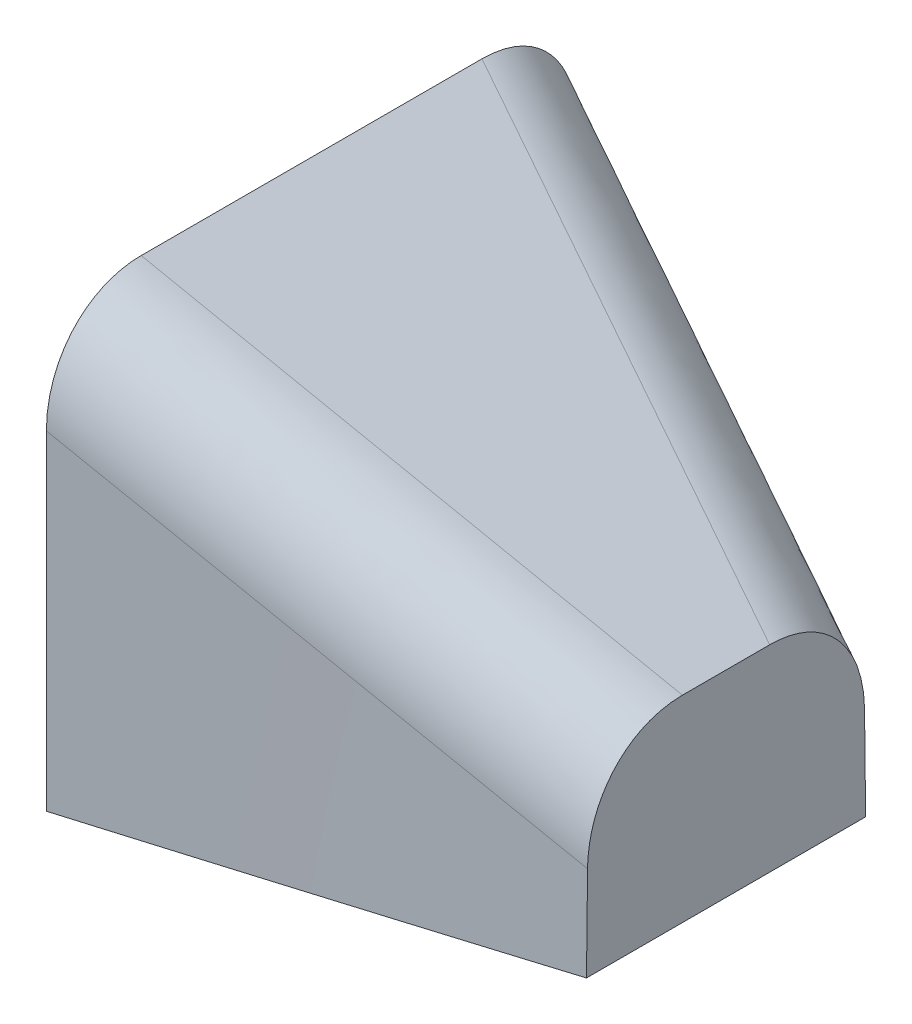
ISO-10303-21;
HEADER;
FILE_DESCRIPTION(('STEP AP214'),'2;1');
FILE_NAME('part.step','',(''),(''),'','','');
FILE_SCHEMA(('AUTOMOTIVE_DESIGN { 1 0 10303 214 1 1 1 1 }'));
ENDSEC;
DATA;
#1=APPLICATION_CONTEXT('core data for automotive mechanical design processes');
#2=APPLICATION_PROTOCOL_DEFINITION('international standard','automotive_design',2000,#1);
#3=PRODUCT_CONTEXT('',#1,'mechanical');
#4=PRODUCT('Part','Part','',(#3));
#5=PRODUCT_RELATED_PRODUCT_CATEGORY('part','',(#4));
#6=PRODUCT_DEFINITION_FORMATION('','',#4);
#7=PRODUCT_DEFINITION_CONTEXT('part definition',#1,'design');
#8=PRODUCT_DEFINITION('design','',#6,#7);
#9=PRODUCT_DEFINITION_SHAPE('','',#8);
#10=(LENGTH_UNIT() NAMED_UNIT(*) SI_UNIT(.MILLI.,.METRE.));
#11=(NAMED_UNIT(*) PLANE_ANGLE_UNIT() SI_UNIT($,.RADIAN.));
#12=(NAMED_UNIT(*) SI_UNIT($,.STERADIAN.) SOLID_ANGLE_UNIT());
#13=UNCERTAINTY_MEASURE_WITH_UNIT(LENGTH_MEASURE(1.E-05),#10,'distance_accuracy_value','');
#14=(GEOMETRIC_REPRESENTATION_CONTEXT(3) GLOBAL_UNCERTAINTY_ASSIGNED_CONTEXT((#13)) GLOBAL_UNIT_ASSIGNED_CONTEXT((#10,
#11,#12)) REPRESENTATION_CONTEXT('',''));
#15=CARTESIAN_POINT('',(0.,0.,0.));
#16=DIRECTION('',(0.,0.,1.));
#17=DIRECTION('',(1.,0.,0.));
#18=AXIS2_PLACEMENT_3D('',#15,#16,#17);
#19=CARTESIAN_POINT('',(0.,119.10399609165,-25.570067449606));
#20=DIRECTION('',(0.,-1.,0.));
#21=DIRECTION('',(0.,0.,-1.));
#22=AXIS2_PLACEMENT_3D('',#19,#20,#21);
#23=PLANE('',#22);
#24=CARTESIAN_POINT('',(39.0699557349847,119.10399609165,-13.1565904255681));
#25=CARTESIAN_POINT('',(37.215246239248,119.10399609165,-13.7293949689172));
#26=CARTESIAN_POINT('',(35.3600451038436,119.10399609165,-14.3006063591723));
#27=CARTESIAN_POINT('',(31.6487247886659,119.10399609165,-15.4400346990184));
#28=CARTESIAN_POINT('',(29.7926056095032,119.10399609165,-16.008251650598));
#29=CARTESIAN_POINT('',(26.079512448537,119.10399609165,-17.1418835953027));
#30=CARTESIAN_POINT('',(24.2225384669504,119.10399609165,-17.7072985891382));
#31=CARTESIAN_POINT('',(20.5077910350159,119.10399609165,-18.8354985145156));
#32=CARTESIAN_POINT('',(18.6500175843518,119.10399609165,-19.3982834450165));
#33=CARTESIAN_POINT('',(13.994811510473,119.10399609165,-20.8051346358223));
#34=CARTESIAN_POINT('',(11.1969067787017,119.10399609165,-21.6476387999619));
#35=CARTESIAN_POINT('',(5.59956452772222,119.10399609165,-23.3275341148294));
#36=CARTESIAN_POINT('',(2.80012700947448,119.10399609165,-24.1649252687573));
#37=CARTESIAN_POINT('',(0.,119.10399609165,-25.));
#38=B_SPLINE_CURVE_WITH_KNOTS('',3,(#24,#25,#26,#27,#28,#29,#30,#31,#32,#33,#34,#35,#36,#37),
.UNSPECIFIED.,.F.,.F.,(4,2,2,2,2,2,4),(0.,5.82344027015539,11.6468766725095,17.4703115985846,
23.2937488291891,32.0597435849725,40.8257328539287),.UNSPECIFIED.);
#39=CARTESIAN_POINT('',(39.0699557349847,119.10399609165,-13.1565904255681));
#40=VERTEX_POINT('',#39);
#41=CARTESIAN_POINT('',(0.,119.10399609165,-25.));
#42=VERTEX_POINT('',#41);
#43=EDGE_CURVE('E96',#40,#42,#38,.T.);
#44=ORIENTED_EDGE('',*,*,#43,.F.);
#45=DIRECTION('',(0.,0.,-1.));
#46=VECTOR('',#45,1.);
#47=CARTESIAN_POINT('',(39.0699557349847,119.10399609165,-12.9422863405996));
#48=LINE('',#47,#46);
#49=CARTESIAN_POINT('',(39.0699557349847,119.10399609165,13.1565904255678));
#50=VERTEX_POINT('',#49);
#51=EDGE_CURVE('E294',#50,#40,#48,.T.);
#52=ORIENTED_EDGE('',*,*,#51,.F.);
#53=CARTESIAN_POINT('',(0.,119.10399609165,25.));
#54=CARTESIAN_POINT('',(1.86018533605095,119.10399609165,24.4452471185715));
#55=CARTESIAN_POINT('',(3.72006445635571,119.10399609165,23.889466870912));
#56=CARTESIAN_POINT('',(7.43916829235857,119.10399609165,22.7757182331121));
#57=CARTESIAN_POINT('',(9.29839300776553,119.10399609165,22.2177498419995));
#58=CARTESIAN_POINT('',(13.01614463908,119.10399609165,21.0994919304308));
#59=CARTESIAN_POINT('',(14.8746715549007,119.10399609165,20.5392024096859));
#60=CARTESIAN_POINT('',(18.5909786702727,119.10399609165,19.416154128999));
#61=CARTESIAN_POINT('',(20.4487588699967,119.10399609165,18.8533953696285));
#62=CARTESIAN_POINT('',(25.1020502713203,119.10399609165,17.4402300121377));
#63=CARTESIAN_POINT('',(27.8970572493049,119.10399609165,16.5881619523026));
#64=CARTESIAN_POINT('',(33.4850641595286,119.10399609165,14.8774572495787));
#65=CARTESIAN_POINT('',(36.2780640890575,119.10399609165,14.0188205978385));
#66=CARTESIAN_POINT('',(39.0699557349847,119.10399609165,13.1565904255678));
#67=B_SPLINE_CURVE_WITH_KNOTS('',3,(#53,#54,#55,#56,#57,#58,#59,#60,#61,#62,#63,#64,#65,#66),
.UNSPECIFIED.,.F.,.F.,(4,2,2,2,2,2,4),(0.,5.82343210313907,11.6468667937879,17.4703022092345,
23.2937362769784,32.0597282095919,40.825731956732),.UNSPECIFIED.);
#68=CARTESIAN_POINT('',(0.,119.10399609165,25.));
#69=VERTEX_POINT('',#68);
#70=EDGE_CURVE('E104',#69,#50,#67,.T.);
#71=ORIENTED_EDGE('',*,*,#70,.F.);
#72=DIRECTION('',(0.,0.,1.));
#73=VECTOR('',#72,1.);
#74=CARTESIAN_POINT('',(0.,119.10399609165,25.));
#75=LINE('',#74,#73);
#76=EDGE_CURVE('E105',#42,#69,#75,.T.);
#77=ORIENTED_EDGE('',*,*,#76,.F.);
#78=EDGE_LOOP('',(#44,#52,#71,#77));
#79=FACE_BOUND('',#78,.T.);
#80=ADVANCED_FACE('F34',(#79),#23,.T.);
#81=CARTESIAN_POINT('',(0.,160.,25.));
#82=DIRECTION('',(-1.,0.,0.));
#83=DIRECTION('',(0.,0.,-1.));
#84=AXIS2_PLACEMENT_3D('',#81,#82,#83);
#85=PLANE('',#84);
#86=DIRECTION('',(0.,-1.,0.));
#87=VECTOR('',#86,1.);
#88=CARTESIAN_POINT('',(0.,80.,-25.));
#89=LINE('',#88,#87);
#90=CARTESIAN_POINT('',(0.,150.154991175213,-25.));
#91=VERTEX_POINT('',#90);
#92=EDGE_CURVE('E100',#91,#42,#89,.T.);
#93=ORIENTED_EDGE('',*,*,#92,.T.);
#94=ORIENTED_EDGE('',*,*,#76,.T.);
#95=DIRECTION('',(0.,1.,0.));
#96=VECTOR('',#95,1.);
#97=CARTESIAN_POINT('',(0.,80.,25.));
#98=LINE('',#97,#96);
#99=CARTESIAN_POINT('',(0.,150.154991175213,25.));
#100=VERTEX_POINT('',#99);
#101=EDGE_CURVE('E114',#69,#100,#98,.T.);
#102=ORIENTED_EDGE('',*,*,#101,.T.);
#103=CARTESIAN_POINT('',(-13.9152250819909,158.066601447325,29.2611862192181));
#104=CARTESIAN_POINT('',(-9.9306901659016,165.675261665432,28.0738819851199));
#105=CARTESIAN_POINT('',(-11.8656191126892,166.781048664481,19.6946692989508));
#106=CARTESIAN_POINT('',(-11.5961859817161,156.747772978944,28.550792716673));
#107=CARTESIAN_POINT('',(-7.61599398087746,164.352442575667,27.3596525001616));
#108=CARTESIAN_POINT('',(-9.54895712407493,165.457106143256,18.9849816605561));
#109=CARTESIAN_POINT('',(-9.27706434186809,155.429057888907,27.8404971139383));
#110=CARTESIAN_POINT('',(-5.3006369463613,163.029245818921,26.6452235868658));
#111=CARTESIAN_POINT('',(-7.23226743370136,164.133147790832,18.2754140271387));
#112=CARTESIAN_POINT('',(-4.63865598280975,152.791854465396,26.4201017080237));
#113=CARTESIAN_POINT('',(-0.669879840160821,160.38282771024,25.2163614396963));
#114=CARTESIAN_POINT('',(-2.59883264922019,161.485199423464,16.8565187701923));
#115=CARTESIAN_POINT('',(-2.31936926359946,151.473366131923,25.7100019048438));
#116=CARTESIAN_POINT('',(1.64546471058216,159.059638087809,24.5019453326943));
#117=CARTESIAN_POINT('',(-0.282087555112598,160.161209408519,16.1471911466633));
#118=CARTESIAN_POINT('',(-4.81582611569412E-09,150.154991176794,25.0000000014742));
#119=CARTESIAN_POINT('',(3.96133038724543,157.736150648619,23.7873728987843));
#120=CARTESIAN_POINT('',(2.03468524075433,158.837203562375,15.4379835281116));
#121=CARTESIAN_POINT('',(0.278768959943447,149.996534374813,24.9146643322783));
#122=CARTESIAN_POINT('',(4.23960374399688,157.577121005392,23.7015102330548));
#123=CARTESIAN_POINT('',(2.31314183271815,158.678069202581,15.3527434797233));
#124=CARTESIAN_POINT('',(0.557539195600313,149.838079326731,24.8293301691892));
#125=CARTESIAN_POINT('',(4.51788587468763,157.418086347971,23.6156449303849));
#126=CARTESIAN_POINT('',(2.59159885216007,158.518934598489,15.2675052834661));
#127=CARTESIAN_POINT('',(5.75387106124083,146.884492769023,23.2387202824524));
#128=CARTESIAN_POINT('',(9.70227806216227,154.455272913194,22.0159768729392));
#129=CARTESIAN_POINT('',(7.78207646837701,155.552643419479,13.6786907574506));
#130=CARTESIAN_POINT('',(10.67183054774,144.089910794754,21.7339159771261));
#131=CARTESIAN_POINT('',(14.6108651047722,151.650078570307,20.5014318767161));
#132=CARTESIAN_POINT('',(12.6942309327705,152.745410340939,12.1756944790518));
#133=CARTESIAN_POINT('',(18.8692024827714,139.433356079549,19.226822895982));
#134=CARTESIAN_POINT('',(22.7940417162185,146.97349841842,17.9765566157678));
#135=CARTESIAN_POINT('',(20.8814161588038,148.066539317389,9.67183491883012));
#136=CARTESIAN_POINT('',(22.1483572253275,137.571022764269,18.2242294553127));
#137=CARTESIAN_POINT('',(26.0664924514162,145.103334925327,16.9668713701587));
#138=CARTESIAN_POINT('',(24.1563597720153,146.194951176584,8.67059359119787));
#139=CARTESIAN_POINT('',(28.7071244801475,133.847002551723,16.2195827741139));
#140=CARTESIAN_POINT('',(32.6115621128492,141.362911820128,14.9474762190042));
#141=CARTESIAN_POINT('',(30.7064024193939,142.451686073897,6.66878551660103));
#142=CARTESIAN_POINT('',(31.9867369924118,131.985315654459,15.2175295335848));
#143=CARTESIAN_POINT('',(35.8839613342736,139.492777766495,13.9378340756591));
#144=CARTESIAN_POINT('',(33.9815014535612,140.580009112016,5.66821876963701));
#145=CARTESIAN_POINT('',(36.5343497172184,129.40454815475,13.8285760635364));
#146=CARTESIAN_POINT('',(40.4227224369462,136.898934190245,12.5374995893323));
#147=CARTESIAN_POINT('',(38.5226229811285,137.984816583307,4.28143365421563));
#148=CARTESIAN_POINT('',(37.8021329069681,128.68515796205,13.4414202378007));
#149=CARTESIAN_POINT('',(41.6876078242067,136.176068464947,12.147249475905));
#150=CARTESIAN_POINT('',(39.7885714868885,137.261343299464,3.89489386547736));
#151=CARTESIAN_POINT('',(39.0699557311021,127.965824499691,13.0543110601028));
#152=CARTESIAN_POINT('',(42.9527410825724,135.453061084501,11.7569253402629));
#153=CARTESIAN_POINT('',(41.0545335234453,136.537862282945,3.50841287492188));
#154=CARTESIAN_POINT('',(40.0760782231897,127.394972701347,12.7471071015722));
#155=CARTESIAN_POINT('',(43.9563680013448,134.879501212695,11.44728217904));
#156=CARTESIAN_POINT('',(42.0591796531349,135.963719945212,3.20170723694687));
#157=CARTESIAN_POINT('',(41.0822266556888,126.82415818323,12.4399336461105));
#158=CARTESIAN_POINT('',(44.960161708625,134.305846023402,11.1375891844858));
#159=CARTESIAN_POINT('',(43.0638346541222,135.389572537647,2.89504015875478));
#160=CARTESIAN_POINT('',(43.0945754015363,125.682603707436,11.8256477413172));
#161=CARTESIAN_POINT('',(46.9677521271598,133.158533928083,10.5182055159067));
#162=CARTESIAN_POINT('',(45.0731623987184,134.241267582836,2.28178312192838));
#163=CARTESIAN_POINT('',(44.1007757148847,125.111863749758,11.5185352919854));
#164=CARTESIAN_POINT('',(47.9715411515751,132.584881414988,10.2085172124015));
#165=CARTESIAN_POINT('',(46.0778351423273,133.667110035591,1.97519316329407));
#166=CARTESIAN_POINT('',(45.1070019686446,124.541161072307,11.2114533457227));
#167=CARTESIAN_POINT('',(48.9754775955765,132.011144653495,9.89878504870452));
#168=CARTESIAN_POINT('',(47.0825167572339,133.092947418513,1.66864176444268));
#169=(BOUNDED_SURFACE() B_SPLINE_SURFACE(3,2,((#103,#104,#105),(#106,#107,#108),(#109,#110,
#111),(#112,#113,#114),(#115,#116,#117),(#118,#119,#120),(#121,#122,#123),(#124,#125,#126),
(#127,#128,#129),(#130,#131,#132),(#133,#134,#135),(#136,#137,#138),(#139,#140,#141),(#142,#143,
#144),(#145,#146,#147),(#148,#149,#150),(#151,#152,#153),(#154,#155,#156),(#157,#158,#159),
(#160,#161,#162),(#163,#164,#165),(#166,#167,#168)),.UNSPECIFIED.,.F.,.F.,
.F.) B_SPLINE_SURFACE_WITH_KNOTS((4,2,3,2,2,2,2,3,2,4),(3,3),(0.,8.28315324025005,
16.5663064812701,17.5618712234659,35.1237431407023,46.8316565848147,58.5395700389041,
63.0649506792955,66.6562171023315,70.247483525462),(0.,1.),
.UNSPECIFIED.) GEOMETRIC_REPRESENTATION_ITEM() RATIONAL_B_SPLINE_SURFACE(((1.,0.755544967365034,
1.),(1.,0.755730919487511,1.),(1.,0.755921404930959,1.),(1.,0.756311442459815,1.),(1.,
0.756510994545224,1.),(1.,0.756715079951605,1.),(1.,0.756739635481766,1.),(1.,0.756764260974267,
1.),(1.,0.757224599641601,1.),(1.,0.757682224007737,1.),(1.,0.758487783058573,1.),(1.,
0.758821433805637,1.),(1.,0.759514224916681,1.),(1.,0.759873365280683,1.),(1.,0.760391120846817,
1.),(1.,0.760537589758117,1.),(1.,0.760686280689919,1.),(1.,0.760804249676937,1.),(1.,
0.760923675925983,1.),(1.,0.761165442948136,1.),(1.,0.761287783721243,1.),(1.,0.761411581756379,1.))) REPRESENTATION_ITEM('') SURFACE());
#170=CARTESIAN_POINT('',(0.,150.154991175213,25.));
#171=CARTESIAN_POINT('',(0.,150.463937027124,25.0000077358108));
#172=CARTESIAN_POINT('',(0.,150.772959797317,24.9884697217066));
#173=CARTESIAN_POINT('',(0.,151.389411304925,24.9414954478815));
#174=CARTESIAN_POINT('',(0.,151.696838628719,24.9060407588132));
#175=CARTESIAN_POINT('',(0.,152.310284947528,24.8100458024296));
#176=CARTESIAN_POINT('',(0.,152.616273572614,24.7493093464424));
#177=CARTESIAN_POINT('',(0.,153.221942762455,24.6020479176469));
#178=CARTESIAN_POINT('',(0.,153.521624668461,24.5155284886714));
#179=CARTESIAN_POINT('',(0.,154.113697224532,24.3156388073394));
#180=CARTESIAN_POINT('',(0.,154.406041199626,24.2021296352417));
#181=CARTESIAN_POINT('',(0.,154.978806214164,23.9482387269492));
#182=CARTESIAN_POINT('',(0.,155.259229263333,23.8078615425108));
#183=CARTESIAN_POINT('',(0.,155.804155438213,23.5008094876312));
#184=CARTESIAN_POINT('',(0.,156.068706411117,23.3342197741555));
#185=CARTESIAN_POINT('',(0.,156.579496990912,22.9750091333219));
#186=CARTESIAN_POINT('',(0.,156.825740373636,22.7823935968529));
#187=CARTESIAN_POINT('',(0.,157.265911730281,22.3990246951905));
#188=CARTESIAN_POINT('',(0.,157.462476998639,22.2112934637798));
#189=CARTESIAN_POINT('',(0.,157.837105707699,21.8181863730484));
#190=CARTESIAN_POINT('',(0.,158.015170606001,21.612811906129));
#191=CARTESIAN_POINT('',(0.,158.350842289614,21.1859528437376));
#192=CARTESIAN_POINT('',(0.,158.508448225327,20.9644675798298));
#193=CARTESIAN_POINT('',(0.,158.801486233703,20.5072978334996));
#194=CARTESIAN_POINT('',(0.,158.936920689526,20.2716148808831));
#195=CARTESIAN_POINT('',(0.,159.170184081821,19.8158247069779));
#196=CARTESIAN_POINT('',(0.,159.270540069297,19.5970055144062));
#197=CARTESIAN_POINT('',(0.,159.452170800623,19.1515886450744));
#198=CARTESIAN_POINT('',(0.,159.53344609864,18.92499119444));
#199=CARTESIAN_POINT('',(0.,159.67648914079,18.4659025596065));
#200=CARTESIAN_POINT('',(0.,159.738270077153,18.233415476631));
#201=CARTESIAN_POINT('',(0.,159.842281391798,17.764190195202));
#202=CARTESIAN_POINT('',(0.,159.884518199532,17.5274534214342));
#203=CARTESIAN_POINT('',(0.,159.944921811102,17.0856746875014));
#204=CARTESIAN_POINT('',(0.,159.965679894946,16.8809807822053));
#205=CARTESIAN_POINT('',(0.,159.993210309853,16.4711420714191));
#206=CARTESIAN_POINT('',(0.,160.000015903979,16.2659995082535));
#207=CARTESIAN_POINT('',(0.,160.,16.0608686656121));
#208=B_SPLINE_CURVE_WITH_KNOTS('',3,(#170,#171,#172,#173,#174,#175,#176,#177,#178,#179,#180,
#181,#182,#183,#184,#185,#186,#187,#188,#189,#190,#191,#192,#193,#194,#195,#196,#197,#198,#199,
#200,#201,#202,#203,#204,#205,#206,#207),.UNSPECIFIED.,.F.,.F.,(4,2,2,2,2,2,2,2,2,2,2,2,2,2,2,2,
2,2,4),(0.,0.926737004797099,1.85418893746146,2.78897626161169,3.72356273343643,
4.66306794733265,5.60241413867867,6.53876938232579,7.4749309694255,8.28921668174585,
9.10343818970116,9.91769349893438,10.7318612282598,11.45319833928,12.1745144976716,
12.8953414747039,13.6159311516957,14.2326940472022,14.8479848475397),.UNSPECIFIED.);
#209=CARTESIAN_POINT('',(0.,160.,16.0608686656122));
#210=VERTEX_POINT('',#209);
#211=EDGE_CURVE('E287',#100,#210,#208,.T.);
#212=ORIENTED_EDGE('',*,*,#211,.T.);
#213=DIRECTION('',(0.,0.,-1.));
#214=VECTOR('',#213,1.);
#215=CARTESIAN_POINT('',(0.,160.,0.));
#216=LINE('',#215,#214);
#217=CARTESIAN_POINT('',(0.,160.,0.));
#218=VERTEX_POINT('',#217);
#219=EDGE_CURVE('E51',#210,#218,#216,.T.);
#220=ORIENTED_EDGE('',*,*,#219,.T.);
#221=DIRECTION('',(0.,0.,-1.));
#222=VECTOR('',#221,1.);
#223=CARTESIAN_POINT('',(0.,160.,0.));
#224=LINE('',#223,#222);
#225=CARTESIAN_POINT('',(0.,160.,-16.0608686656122));
#226=VERTEX_POINT('',#225);
#227=EDGE_CURVE('E11',#218,#226,#224,.T.);
#228=ORIENTED_EDGE('',*,*,#227,.T.);
#229=CARTESIAN_POINT('',(-11.8506608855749,166.772500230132,-19.690087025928));
#230=CARTESIAN_POINT('',(-9.9157404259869,165.666718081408,-28.0692690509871));
#231=CARTESIAN_POINT('',(-13.9002514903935,158.05808607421,-29.2565993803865));
#232=CARTESIAN_POINT('',(-9.53649181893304,165.449982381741,-18.9811635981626));
#233=CARTESIAN_POINT('',(-7.60353445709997,164.345322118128,-27.3558079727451));
#234=CARTESIAN_POINT('',(-11.5837076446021,156.740677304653,-28.5469707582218));
#235=CARTESIAN_POINT('',(-7.22229510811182,164.127448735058,-18.2723599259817));
#236=CARTESIAN_POINT('',(-5.29066910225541,163.023549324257,-26.6421479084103));
#237=CARTESIAN_POINT('',(-9.26708143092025,155.423381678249,-27.8374398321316));
#238=CARTESIAN_POINT('',(-2.59384639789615,161.482349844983,-16.854992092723));
#239=CARTESIAN_POINT('',(-0.664895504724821,160.379979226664,-25.2148234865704));
#240=CARTESIAN_POINT('',(-4.63366426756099,152.789016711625,-26.418573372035));
#241=CARTESIAN_POINT('',(-0.2795943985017,160.159784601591,-16.1464279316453));
#242=CARTESIAN_POINT('',(1.64795739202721,159.058213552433,-24.5011762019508));
#243=CARTESIAN_POINT('',(-2.31687331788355,151.471947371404,-25.7092378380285));
#244=CARTESIAN_POINT('',(2.03468524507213,158.837203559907,-15.4379835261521));
#245=CARTESIAN_POINT('',(3.96133039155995,157.736150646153,-23.7873728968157));
#246=CARTESIAN_POINT('',(-3.15662584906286E-10,150.154991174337,-25.0000000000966));
#247=CARTESIAN_POINT('',(2.31563499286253,158.676644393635,-15.3519802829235));
#248=CARTESIAN_POINT('',(4.24209518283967,157.575697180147,-23.700741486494));
#249=CARTESIAN_POINT('',(0.281264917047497,149.995115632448,-24.9139002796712));
#250=CARTESIAN_POINT('',(2.59658517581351,158.516084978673,-15.2659789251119));
#251=CARTESIAN_POINT('',(4.52286890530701,157.415238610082,-23.6141073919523));
#252=CARTESIAN_POINT('',(0.562531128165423,149.835241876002,-24.827802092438));
#253=CARTESIAN_POINT('',(7.78706293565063,155.549793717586,-13.6771650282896));
#254=CARTESIAN_POINT('',(9.70726393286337,154.452423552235,-22.0144384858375));
#255=CARTESIAN_POINT('',(5.75886342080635,146.881655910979,-23.237192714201));
#256=CARTESIAN_POINT('',(12.6967242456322,152.743985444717,-12.1749319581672));
#257=CARTESIAN_POINT('',(14.6133598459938,151.648652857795,-20.5006621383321));
#258=CARTESIAN_POINT('',(10.6743269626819,144.08849269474,-21.7331524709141));
#259=CARTESIAN_POINT('',(20.8797539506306,148.067489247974,-9.67234326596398));
#260=CARTESIAN_POINT('',(22.7923820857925,146.974446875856,-17.9770686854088));
#261=CARTESIAN_POINT('',(18.8675382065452,139.43430147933,-19.2273319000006));
#262=CARTESIAN_POINT('',(24.1530352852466,146.196851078,-8.67160997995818));
#263=CARTESIAN_POINT('',(26.0631719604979,145.105232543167,-16.9678958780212));
#264=CARTESIAN_POINT('',(22.1450284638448,137.57291327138,-18.2252472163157));
#265=CARTESIAN_POINT('',(30.6997532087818,142.455486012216,-6.67081726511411));
#266=CARTESIAN_POINT('',(32.604919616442,141.366707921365,-14.949525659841));
#267=CARTESIAN_POINT('',(28.7004662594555,133.850782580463,-16.2216174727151));
#268=CARTESIAN_POINT('',(33.973189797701,140.584759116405,-5.67075783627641));
#269=CARTESIAN_POINT('',(35.8756580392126,139.497522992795,-13.9403959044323));
#270=CARTESIAN_POINT('',(31.9784137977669,131.990040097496,-15.2200724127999));
#271=CARTESIAN_POINT('',(38.5159734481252,137.988616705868,-4.28346399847));
#272=CARTESIAN_POINT('',(40.4160772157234,136.902731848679,-12.5395498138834));
#273=CARTESIAN_POINT('',(36.5276905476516,129.408326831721,-13.8306096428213));
#274=CARTESIAN_POINT('',(39.7852466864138,137.26324338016,-3.8959088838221));
#275=CARTESIAN_POINT('',(41.6842845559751,136.177967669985,-12.1482747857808));
#276=CARTESIAN_POINT('',(37.7988032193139,128.687047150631,-13.4424369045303));
#277=CARTESIAN_POINT('',(41.0545335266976,136.537862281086,-3.50841287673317));
#278=CARTESIAN_POINT('',(42.952741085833,135.453061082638,-11.7569253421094));
#279=CARTESIAN_POINT('',(39.0699557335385,127.965824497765,-13.0543110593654));
#280=CARTESIAN_POINT('',(42.0566860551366,135.965145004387,-3.20246850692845));
#281=CARTESIAN_POINT('',(43.9538773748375,134.8809245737,-11.4480505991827));
#282=CARTESIAN_POINT('',(40.0735809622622,127.396389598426,-12.7478696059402));
#283=CARTESIAN_POINT('',(43.0588474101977,135.392422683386,-2.89656250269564));
#284=CARTESIAN_POINT('',(44.9551795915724,134.308693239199,-11.1391262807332));
#285=CARTESIAN_POINT('',(41.0772320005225,126.826991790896,-12.4414585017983));
#286=CARTESIAN_POINT('',(45.0631877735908,134.246967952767,-2.28482722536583));
#287=CARTESIAN_POINT('',(46.9577869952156,133.164228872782,-10.5212799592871));
#288=CARTESIAN_POINT('',(43.0845856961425,125.688270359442,-11.8286969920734));
#289=CARTESIAN_POINT('',(46.0653667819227,133.674235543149,-1.97899795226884));
#290=CARTESIAN_POINT('',(47.9590845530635,132.592000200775,-10.2123603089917));
#291=CARTESIAN_POINT('',(44.0882883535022,125.118946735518,-11.5223465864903));
#292=CARTESIAN_POINT('',(47.0675546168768,133.10149808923,-1.67320704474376));
#293=CARTESIAN_POINT('',(48.960528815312,132.019687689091,-9.90339701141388));
#294=CARTESIAN_POINT('',(45.0920168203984,124.549660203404,-11.2160265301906));
#295=(BOUNDED_SURFACE() B_SPLINE_SURFACE(3,2,((#229,#230,#231),(#232,#233,#234),(#235,#236,
#237),(#238,#239,#240),(#241,#242,#243),(#244,#245,#246),(#247,#248,#249),(#250,#251,#252),
(#253,#254,#255),(#256,#257,#258),(#259,#260,#261),(#262,#263,#264),(#265,#266,#267),(#268,#269,
#270),(#271,#272,#273),(#274,#275,#276),(#277,#278,#279),(#280,#281,#282),(#283,#284,#285),
(#286,#287,#288),(#289,#290,#291),(#292,#293,#294)),.UNSPECIFIED.,.F.,.F.,
.F.) B_SPLINE_SURFACE_WITH_KNOTS((4,2,3,2,2,2,2,3,2,4),(3,3),(0.,8.27423946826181,
16.5484789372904,17.5529574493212,35.1059155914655,46.8078865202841,58.5098574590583,
63.0471231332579,66.6294757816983,70.2118284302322),(0.,1.),
.UNSPECIFIED.) GEOMETRIC_REPRESENTATION_ITEM() RATIONAL_B_SPLINE_SURFACE(((1.,0.755546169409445,
1.),(1.,0.75573194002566,1.),(1.,0.755922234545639,1.),(1.,0.756311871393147,1.),(1.,
0.756511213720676,1.),(1.,0.75671507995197,1.),(1.,0.756739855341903,1.),(1.,0.756764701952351,
1.),(1.,0.757225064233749,1.),(1.,0.757682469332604,1.),(1.,0.758487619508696,1.),(1.,
0.758821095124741,1.),(1.,0.759513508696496,1.),(1.,0.75987244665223,1.),(1.,0.760390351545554,
1.),(1.,0.760537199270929,1.),(1.,0.760686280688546,1.),(1.,0.760803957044,1.),(1.,
0.760923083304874,1.),(1.,0.761164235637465,1.),(1.,0.761286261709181,1.),(1.,0.761409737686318,1.))) REPRESENTATION_ITEM('') SURFACE());
#296=CARTESIAN_POINT('',(0.,160.,-16.0608686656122));
#297=CARTESIAN_POINT('',(0.,160.000035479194,-16.3035735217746));
#298=CARTESIAN_POINT('',(0.,159.990495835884,-16.5463220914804));
#299=CARTESIAN_POINT('',(0.,159.951906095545,-17.0303459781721));
#300=CARTESIAN_POINT('',(0.,159.92284889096,-17.2716207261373));
#301=CARTESIAN_POINT('',(0.,159.844852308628,-17.7510244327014));
#302=CARTESIAN_POINT('',(0.,159.795907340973,-17.9891524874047));
#303=CARTESIAN_POINT('',(0.,159.678080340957,-18.4603973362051));
#304=CARTESIAN_POINT('',(0.,159.609201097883,-18.6935148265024));
#305=CARTESIAN_POINT('',(0.,159.451494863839,-19.1535870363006));
#306=CARTESIAN_POINT('',(0.,159.362616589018,-19.3805241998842));
#307=CARTESIAN_POINT('',(0.,159.165501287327,-19.8258285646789));
#308=CARTESIAN_POINT('',(0.,159.057264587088,-20.0441959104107));
#309=CARTESIAN_POINT('',(0.,158.822309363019,-20.4705018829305));
#310=CARTESIAN_POINT('',(0.,158.695606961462,-20.6784493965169));
#311=CARTESIAN_POINT('',(0.,158.424684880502,-21.0825892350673));
#312=CARTESIAN_POINT('',(0.,158.280465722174,-21.2787819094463));
#313=CARTESIAN_POINT('',(0.,157.979955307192,-21.6528855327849));
#314=CARTESIAN_POINT('',(0.,157.824104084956,-21.8311504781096));
#315=CARTESIAN_POINT('',(0.,157.498330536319,-22.1743044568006));
#316=CARTESIAN_POINT('',(0.,157.328408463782,-22.3391937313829));
#317=CARTESIAN_POINT('',(0.,156.975896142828,-22.6548149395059));
#318=CARTESIAN_POINT('',(0.,156.793305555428,-22.8055464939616));
#319=CARTESIAN_POINT('',(0.,156.416844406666,-23.0923255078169));
#320=CARTESIAN_POINT('',(0.,156.222969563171,-23.2283673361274));
#321=CARTESIAN_POINT('',(0.,155.815864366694,-23.4915429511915));
#322=CARTESIAN_POINT('',(0.,155.602151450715,-23.6179297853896));
#323=CARTESIAN_POINT('',(0.,155.165573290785,-23.8539133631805));
#324=CARTESIAN_POINT('',(0.,154.942704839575,-23.9635041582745));
#325=CARTESIAN_POINT('',(0.,154.489223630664,-24.165922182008));
#326=CARTESIAN_POINT('',(0.,154.25860318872,-24.2587321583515));
#327=CARTESIAN_POINT('',(0.,153.791293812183,-24.4275731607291));
#328=CARTESIAN_POINT('',(0.,153.554604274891,-24.5036025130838));
#329=CARTESIAN_POINT('',(0.,153.058541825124,-24.6442122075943));
#330=CARTESIAN_POINT('',(0.,152.798802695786,-24.7074997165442));
#331=CARTESIAN_POINT('',(0.,152.275521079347,-24.8153142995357));
#332=CARTESIAN_POINT('',(0.,152.011979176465,-24.8598442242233));
#333=CARTESIAN_POINT('',(0.,151.483359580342,-24.9305104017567));
#334=CARTESIAN_POINT('',(0.,151.218289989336,-24.9567077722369));
#335=CARTESIAN_POINT('',(0.,150.687129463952,-24.9914499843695));
#336=CARTESIAN_POINT('',(0.,150.421039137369,-25.0000040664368));
#337=CARTESIAN_POINT('',(0.,150.154991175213,-25.));
#338=B_SPLINE_CURVE_WITH_KNOTS('',3,(#296,#297,#298,#299,#300,#301,#302,#303,#304,#305,#306,
#307,#308,#309,#310,#311,#312,#313,#314,#315,#316,#317,#318,#319,#320,#321,#322,#323,#324,#325,
#326,#327,#328,#329,#330,#331,#332,#333,#334,#335,#336,#337),.UNSPECIFIED.,.F.,.F.,(4,2,2,2,2,2,
2,2,2,2,2,2,2,2,2,2,2,2,2,2,4),(0.,0.727991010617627,1.45624727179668,2.184708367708,
2.91306758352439,3.643316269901,4.37355263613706,5.10315521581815,5.83273609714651,
6.54229050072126,7.25183210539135,7.96139270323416,8.67122434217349,9.41531906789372,
10.159676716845,10.9047953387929,11.6499882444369,12.4512821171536,13.2524541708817,
14.0509423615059,14.8490122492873),.UNSPECIFIED.);
#339=EDGE_CURVE('E113',#226,#91,#338,.T.);
#340=ORIENTED_EDGE('',*,*,#339,.T.);
#341=EDGE_LOOP('',(#93,#94,#102,#212,#220,#228,#340));
#342=FACE_BOUND('',#341,.T.);
#343=ADVANCED_FACE('F111',(#342),#85,.T.);
#344=CARTESIAN_POINT('',(39.0699557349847,137.672022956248,4.11432857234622));
#345=CARTESIAN_POINT('',(39.0699557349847,137.672058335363,4.35702784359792));
#346=CARTESIAN_POINT('',(39.0699557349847,137.662515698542,4.59977073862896));
#347=CARTESIAN_POINT('',(39.0699557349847,137.623915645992,5.08378218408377));
#348=CARTESIAN_POINT('',(39.0699557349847,137.594851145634,5.32505016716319));
#349=CARTESIAN_POINT('',(39.0699557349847,137.516837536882,5.80443633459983));
#350=CARTESIAN_POINT('',(39.0699557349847,137.467883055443,6.04255364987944));
#351=CARTESIAN_POINT('',(39.0699557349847,137.350037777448,6.51377623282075));
#352=CARTESIAN_POINT('',(39.0699557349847,137.281149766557,6.74688219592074));
#353=CARTESIAN_POINT('',(39.0699557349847,137.123426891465,7.20692836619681));
#354=CARTESIAN_POINT('',(39.0699557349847,137.034540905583,7.43385106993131));
#355=CARTESIAN_POINT('',(39.0699557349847,136.837415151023,7.87912774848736));
#356=CARTESIAN_POINT('',(39.0699557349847,136.729175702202,8.0974818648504));
#357=CARTESIAN_POINT('',(39.0699557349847,136.494219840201,8.52376299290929));
#358=CARTESIAN_POINT('',(39.0699557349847,136.367519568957,8.7316989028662));
#359=CARTESIAN_POINT('',(39.0699557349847,136.096609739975,9.13582083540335));
#360=CARTESIAN_POINT('',(39.0699557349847,135.9524007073,9.33200721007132));
#361=CARTESIAN_POINT('',(39.0699557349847,135.651884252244,9.70613981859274));
#362=CARTESIAN_POINT('',(39.0699557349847,135.496013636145,9.8844374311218));
#363=CARTESIAN_POINT('',(39.0699557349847,135.17020326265,10.2276599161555));
#364=CARTESIAN_POINT('',(39.0699557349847,135.000263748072,10.3925850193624));
#365=CARTESIAN_POINT('',(39.0699557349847,134.647712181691,10.7082833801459));
#366=CARTESIAN_POINT('',(39.0699557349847,134.465099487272,10.8590559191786));
#367=CARTESIAN_POINT('',(39.0699557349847,134.088595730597,11.1459212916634));
#368=CARTESIAN_POINT('',(39.0699557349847,133.894700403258,11.2820085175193));
#369=CARTESIAN_POINT('',(39.0699557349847,133.487490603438,11.5453159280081));
#370=CARTESIAN_POINT('',(39.0699557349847,133.27369034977,11.6717843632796));
#371=CARTESIAN_POINT('',(39.0699557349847,132.836931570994,11.9079278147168));
#372=CARTESIAN_POINT('',(39.0699557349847,132.613969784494,12.0175967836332));
#373=CARTESIAN_POINT('',(39.0699557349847,132.160350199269,12.220139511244));
#374=CARTESIAN_POINT('',(39.0699557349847,131.929686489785,12.3130000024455));
#375=CARTESIAN_POINT('',(39.0699557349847,131.462222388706,12.4819689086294));
#376=CARTESIAN_POINT('',(39.0699557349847,131.225419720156,12.5580710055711));
#377=CARTESIAN_POINT('',(39.0699557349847,130.740536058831,12.6955818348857));
#378=CARTESIAN_POINT('',(39.0699557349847,130.492324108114,12.7565277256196));
#379=CARTESIAN_POINT('',(39.0699557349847,129.992300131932,12.8612761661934));
#380=CARTESIAN_POINT('',(39.0699557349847,129.740487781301,12.9050771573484));
#381=CARTESIAN_POINT('',(39.0699557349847,129.235419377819,12.9758085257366));
#382=CARTESIAN_POINT('',(39.0699557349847,128.982171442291,13.0027973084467));
#383=CARTESIAN_POINT('',(39.0699557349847,128.474575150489,13.0405785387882));
#384=CARTESIAN_POINT('',(39.0699557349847,128.220227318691,13.0513780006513));
#385=CARTESIAN_POINT('',(39.0699557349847,127.965824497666,13.0543110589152));
#386=B_SPLINE_CURVE_WITH_KNOTS('',3,(#344,#345,#346,#347,#348,#349,#350,#351,#352,#353,#354,
#355,#356,#357,#358,#359,#360,#361,#362,#363,#364,#365,#366,#367,#368,#369,#370,#371,#372,#373,
#374,#375,#376,#377,#378,#379,#380,#381,#382,#383,#384,#385),.UNSPECIFIED.,.F.,.F.,(4,2,2,2,2,2,
2,2,2,2,2,2,2,2,2,2,2,2,2,2,4),(0.,0.727974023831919,1.45621237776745,2.1846475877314,
2.91298104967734,3.6431979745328,4.37340283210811,5.10297299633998,5.83252128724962,
6.54218789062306,7.25184224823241,7.96153261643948,8.67149302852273,9.41593754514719,
10.1606494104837,10.9059465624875,11.6515242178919,12.417653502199,13.1838524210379,
13.9473745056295,14.7105656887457),.UNSPECIFIED.);
#387=CARTESIAN_POINT('',(39.0699557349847,137.672022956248,4.11432857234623));
#388=VERTEX_POINT('',#387);
#389=CARTESIAN_POINT('',(39.0699557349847,127.965824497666,13.0543110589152));
#390=VERTEX_POINT('',#389);
#391=EDGE_CURVE('E136',#388,#390,#386,.T.);
#392=ORIENTED_EDGE('',*,*,#391,.F.);
#393=CARTESIAN_POINT('',(-11.8656191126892,166.781048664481,19.6946692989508));
#394=CARTESIAN_POINT('',(-9.54895712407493,165.457106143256,18.9849816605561));
#395=CARTESIAN_POINT('',(-7.23226743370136,164.133147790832,18.2754140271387));
#396=CARTESIAN_POINT('',(-2.59883264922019,161.485199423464,16.8565187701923));
#397=CARTESIAN_POINT('',(-0.282087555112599,160.161209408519,16.1471911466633));
#398=CARTESIAN_POINT('',(2.03468524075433,158.837203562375,15.4379835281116));
#399=CARTESIAN_POINT('',(2.31314183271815,158.678069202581,15.3527434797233));
#400=CARTESIAN_POINT('',(2.59159885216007,158.518934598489,15.2675052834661));
#401=CARTESIAN_POINT('',(7.78207646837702,155.552643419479,13.6786907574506));
#402=CARTESIAN_POINT('',(12.6942309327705,152.745410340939,12.1756944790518));
#403=CARTESIAN_POINT('',(20.8814161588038,148.066539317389,9.67183491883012));
#404=CARTESIAN_POINT('',(24.1563597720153,146.194951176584,8.67059359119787));
#405=CARTESIAN_POINT('',(30.7064024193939,142.451686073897,6.66878551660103));
#406=CARTESIAN_POINT('',(33.9815014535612,140.580009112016,5.66821876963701));
#407=CARTESIAN_POINT('',(38.5226229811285,137.984816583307,4.28143365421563));
#408=CARTESIAN_POINT('',(39.7885714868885,137.261343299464,3.89489386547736));
#409=CARTESIAN_POINT('',(41.0545335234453,136.537862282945,3.50841287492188));
#410=CARTESIAN_POINT('',(42.0591796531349,135.963719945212,3.20170723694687));
#411=CARTESIAN_POINT('',(43.0638346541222,135.389572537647,2.89504015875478));
#412=CARTESIAN_POINT('',(45.0731623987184,134.241267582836,2.28178312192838));
#413=CARTESIAN_POINT('',(46.0778351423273,133.667110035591,1.97519316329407));
#414=CARTESIAN_POINT('',(47.0825167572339,133.092947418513,1.66864176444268));
#415=B_SPLINE_CURVE_WITH_KNOTS('',3,(#393,#394,#395,#396,#397,#398,#399,#400,#401,#402,#403,
#404,#405,#406,#407,#408,#409,#410,#411,#412,#413,#414),.UNSPECIFIED.,.F.,.F.,(4,2,3,2,2,2,2,3,
2,4),(0.,8.28315324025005,16.5663064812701,17.5618712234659,35.1237431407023,46.8316565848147,
58.5395700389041,63.0649506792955,66.6562171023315,70.247483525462),.UNSPECIFIED.);
#416=EDGE_CURVE('E198',#210,#388,#415,.T.);
#417=ORIENTED_EDGE('',*,*,#416,.F.);
#418=ORIENTED_EDGE('',*,*,#211,.F.);
#419=CARTESIAN_POINT('',(45.1070019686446,124.541161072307,11.2114533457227));
#420=CARTESIAN_POINT('',(44.1007757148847,125.111863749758,11.5185352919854));
#421=CARTESIAN_POINT('',(43.0945754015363,125.682603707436,11.8256477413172));
#422=CARTESIAN_POINT('',(41.0822266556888,126.82415818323,12.4399336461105));
#423=CARTESIAN_POINT('',(40.0760782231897,127.394972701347,12.7471071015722));
#424=CARTESIAN_POINT('',(39.0699557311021,127.965824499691,13.0543110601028));
#425=CARTESIAN_POINT('',(37.8021329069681,128.68515796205,13.4414202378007));
#426=CARTESIAN_POINT('',(36.5343497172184,129.40454815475,13.8285760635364));
#427=CARTESIAN_POINT('',(31.9867369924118,131.985315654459,15.2175295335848));
#428=CARTESIAN_POINT('',(28.7071244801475,133.847002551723,16.2195827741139));
#429=CARTESIAN_POINT('',(22.1483572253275,137.571022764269,18.2242294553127));
#430=CARTESIAN_POINT('',(18.8692024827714,139.433356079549,19.226822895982));
#431=CARTESIAN_POINT('',(10.67183054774,144.089910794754,21.7339159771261));
#432=CARTESIAN_POINT('',(5.75387106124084,146.884492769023,23.2387202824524));
#433=CARTESIAN_POINT('',(0.557539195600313,149.838079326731,24.8293301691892));
#434=CARTESIAN_POINT('',(0.278768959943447,149.996534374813,24.9146643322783));
#435=CARTESIAN_POINT('',(-4.81582611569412E-09,150.154991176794,25.0000000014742));
#436=CARTESIAN_POINT('',(-2.31936926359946,151.473366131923,25.7100019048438));
#437=CARTESIAN_POINT('',(-4.63865598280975,152.791854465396,26.4201017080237));
#438=CARTESIAN_POINT('',(-9.27706434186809,155.429057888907,27.8404971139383));
#439=CARTESIAN_POINT('',(-11.5961859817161,156.747772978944,28.550792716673));
#440=CARTESIAN_POINT('',(-13.9152250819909,158.066601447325,29.2611862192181));
#441=B_SPLINE_CURVE_WITH_KNOTS('',3,(#419,#420,#421,#422,#423,#424,#425,#426,#427,#428,#429,
#430,#431,#432,#433,#434,#435,#436,#437,#438,#439,#440),.UNSPECIFIED.,.F.,.F.,(4,2,3,2,2,2,2,3,
2,4),(0.,3.59126642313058,7.18253284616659,11.707913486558,23.4158269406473,35.1237403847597,
52.6856123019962,53.681177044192,61.964330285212,70.247483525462),.UNSPECIFIED.);
#442=EDGE_CURVE('E203',#390,#100,#441,.T.);
#443=ORIENTED_EDGE('',*,*,#442,.F.);
#444=EDGE_LOOP('',(#392,#417,#418,#443));
#445=FACE_BOUND('',#444,.T.);
#446=ADVANCED_FACE('F162',(#445),#169,.T.);
#447=CARTESIAN_POINT('',(68.9266626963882,120.609299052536,0.));
#448=DIRECTION('',(0.496177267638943,0.868221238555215,0.));
#449=DIRECTION('',(-0.868221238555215,0.496177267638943,0.));
#450=AXIS2_PLACEMENT_3D('',#447,#448,#449);
#451=PLANE('',#450);
#452=DIRECTION('',(0.,0.,1.));
#453=VECTOR('',#452,1.);
#454=CARTESIAN_POINT('',(39.0699557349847,137.672022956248,12.9422863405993));
#455=LINE('',#454,#453);
#456=CARTESIAN_POINT('',(39.0699557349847,137.672022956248,-4.11432857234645));
#457=VERTEX_POINT('',#456);
#458=EDGE_CURVE('E44',#457,#388,#455,.T.);
#459=ORIENTED_EDGE('',*,*,#458,.F.);
#460=CARTESIAN_POINT('',(47.0675546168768,133.10149808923,-1.67320704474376));
#461=CARTESIAN_POINT('',(46.0653667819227,133.674235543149,-1.97899795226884));
#462=CARTESIAN_POINT('',(45.0631877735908,134.246967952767,-2.28482722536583));
#463=CARTESIAN_POINT('',(43.0588474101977,135.392422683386,-2.89656250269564));
#464=CARTESIAN_POINT('',(42.0566860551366,135.965145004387,-3.20246850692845));
#465=CARTESIAN_POINT('',(41.0545335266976,136.537862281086,-3.50841287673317));
#466=CARTESIAN_POINT('',(39.7852466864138,137.26324338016,-3.8959088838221));
#467=CARTESIAN_POINT('',(38.5159734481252,137.988616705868,-4.28346399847));
#468=CARTESIAN_POINT('',(33.973189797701,140.584759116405,-5.67075783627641));
#469=CARTESIAN_POINT('',(30.6997532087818,142.455486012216,-6.67081726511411));
#470=CARTESIAN_POINT('',(24.1530352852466,146.196851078,-8.67160997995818));
#471=CARTESIAN_POINT('',(20.8797539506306,148.067489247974,-9.67234326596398));
#472=CARTESIAN_POINT('',(12.6967242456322,152.743985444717,-12.1749319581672));
#473=CARTESIAN_POINT('',(7.78706293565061,155.549793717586,-13.6771650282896));
#474=CARTESIAN_POINT('',(2.59658517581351,158.516084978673,-15.2659789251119));
#475=CARTESIAN_POINT('',(2.31563499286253,158.676644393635,-15.3519802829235));
#476=CARTESIAN_POINT('',(2.03468524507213,158.837203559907,-15.4379835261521));
#477=CARTESIAN_POINT('',(-0.279594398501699,160.159784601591,-16.1464279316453));
#478=CARTESIAN_POINT('',(-2.59384639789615,161.482349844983,-16.854992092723));
#479=CARTESIAN_POINT('',(-7.22229510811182,164.127448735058,-18.2723599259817));
#480=CARTESIAN_POINT('',(-9.53649181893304,165.449982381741,-18.9811635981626));
#481=CARTESIAN_POINT('',(-11.8506608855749,166.772500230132,-19.690087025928));
#482=B_SPLINE_CURVE_WITH_KNOTS('',3,(#460,#461,#462,#463,#464,#465,#466,#467,#468,#469,#470,
#471,#472,#473,#474,#475,#476,#477,#478,#479,#480,#481),.UNSPECIFIED.,.F.,.F.,(4,2,3,2,2,2,2,3,
2,4),(0.,3.5823526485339,7.16470529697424,11.7019709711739,23.4039419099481,35.1059128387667,
52.658870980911,53.6633494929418,61.9375889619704,70.2118284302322),.UNSPECIFIED.);
#483=EDGE_CURVE('E197',#457,#226,#482,.T.);
#484=ORIENTED_EDGE('',*,*,#483,.T.);
#485=ORIENTED_EDGE('',*,*,#227,.F.);
#486=ORIENTED_EDGE('',*,*,#219,.F.);
#487=ORIENTED_EDGE('',*,*,#416,.T.);
#488=EDGE_LOOP('',(#459,#484,#485,#486,#487));
#489=FACE_BOUND('',#488,.T.);
#490=ADVANCED_FACE('F152',(#489),#451,.T.);
#491=ORIENTED_EDGE('',*,*,#339,.F.);
#492=ORIENTED_EDGE('',*,*,#483,.F.);
#493=CARTESIAN_POINT('',(39.0699557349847,127.965824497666,-13.0543110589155));
#494=CARTESIAN_POINT('',(39.0699557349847,128.272886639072,-13.0507747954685));
#495=CARTESIAN_POINT('',(39.0699557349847,128.579893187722,-13.0357713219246));
#496=CARTESIAN_POINT('',(39.0699557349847,129.192050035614,-12.9820448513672));
#497=CARTESIAN_POINT('',(39.0699557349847,129.497198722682,-12.9433035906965));
#498=CARTESIAN_POINT('',(39.0699557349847,130.105780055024,-12.8409217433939));
#499=CARTESIAN_POINT('',(39.0699557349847,130.409180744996,-12.7770892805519));
#500=CARTESIAN_POINT('',(39.0699557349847,131.009426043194,-12.6238865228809));
#501=CARTESIAN_POINT('',(39.0699557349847,131.306272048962,-12.5345217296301));
#502=CARTESIAN_POINT('',(39.0699557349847,131.892417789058,-12.3292117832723));
#503=CARTESIAN_POINT('',(39.0699557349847,132.181669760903,-12.2131296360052));
#504=CARTESIAN_POINT('',(39.0699557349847,132.748042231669,-11.9544297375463));
#505=CARTESIAN_POINT('',(39.0699557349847,133.025164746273,-11.8118164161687));
#506=CARTESIAN_POINT('',(39.0699557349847,133.563331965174,-11.5006766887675));
#507=CARTESIAN_POINT('',(39.0699557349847,133.824424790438,-11.3322337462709));
#508=CARTESIAN_POINT('',(39.0699557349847,134.328181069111,-10.9697437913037));
#509=CARTESIAN_POINT('',(39.0699557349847,134.570848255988,-10.7757019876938));
#510=CARTESIAN_POINT('',(39.0699557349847,135.004650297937,-10.3897698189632));
#511=CARTESIAN_POINT('',(39.0699557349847,135.198398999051,-10.2008117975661));
#512=CARTESIAN_POINT('',(39.0699557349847,135.567338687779,-9.8055617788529));
#513=CARTESIAN_POINT('',(39.0699557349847,135.7425311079,-9.59927112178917));
#514=CARTESIAN_POINT('',(39.0699557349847,136.072457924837,-9.17089349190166));
#515=CARTESIAN_POINT('',(39.0699557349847,136.227190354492,-8.94880500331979));
#516=CARTESIAN_POINT('',(39.0699557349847,136.51452652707,-8.49076061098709));
#517=CARTESIAN_POINT('',(39.0699557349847,136.647132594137,-8.25480616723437));
#518=CARTESIAN_POINT('',(39.0699557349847,136.875477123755,-7.7981586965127));
#519=CARTESIAN_POINT('',(39.0699557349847,136.973676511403,-7.57869124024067));
#520=CARTESIAN_POINT('',(39.0699557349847,137.150990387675,-7.1321797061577));
#521=CARTESIAN_POINT('',(39.0699557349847,137.230105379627,-6.90513582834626));
#522=CARTESIAN_POINT('',(39.0699557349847,137.368847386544,-6.44537183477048));
#523=CARTESIAN_POINT('',(39.0699557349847,137.428489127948,-6.21265615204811));
#524=CARTESIAN_POINT('',(39.0699557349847,137.528275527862,-5.74316455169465));
#525=CARTESIAN_POINT('',(39.0699557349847,137.568426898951,-5.50639006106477));
#526=CARTESIAN_POINT('',(39.0699557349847,137.623471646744,-5.07687724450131));
#527=CARTESIAN_POINT('',(39.0699557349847,137.6417654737,-4.88456478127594));
#528=CARTESIAN_POINT('',(39.0699557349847,137.666032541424,-4.49960836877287));
#529=CARTESIAN_POINT('',(39.0699557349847,137.672034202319,-4.30696621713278));
#530=CARTESIAN_POINT('',(39.0699557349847,137.672022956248,-4.11432857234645));
#531=B_SPLINE_CURVE_WITH_KNOTS('',3,(#493,#494,#495,#496,#497,#498,#499,#500,#501,#502,#503,
#504,#505,#506,#507,#508,#509,#510,#511,#512,#513,#514,#515,#516,#517,#518,#519,#520,#521,#522,
#523,#524,#525,#526,#527,#528,#529,#530),.UNSPECIFIED.,.F.,.F.,(4,2,2,2,2,2,2,2,2,2,2,2,2,2,2,2,
2,2,4),(0.,0.921148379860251,1.84300637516,2.77205556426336,3.70090471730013,4.63462708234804,
5.56819368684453,6.49880485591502,7.42922695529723,8.23999749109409,9.05070539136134,
9.86149118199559,10.6721917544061,11.3926344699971,12.1130581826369,12.8329358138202,
13.5525653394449,14.1317247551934,14.7095436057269),.UNSPECIFIED.);
#532=CARTESIAN_POINT('',(39.0699557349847,127.965824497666,-13.0543110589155));
#533=VERTEX_POINT('',#532);
#534=EDGE_CURVE('E60',#533,#457,#531,.T.);
#535=ORIENTED_EDGE('',*,*,#534,.F.);
#536=CARTESIAN_POINT('',(-13.9002514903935,158.05808607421,-29.2565993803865));
#537=CARTESIAN_POINT('',(-11.5837076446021,156.740677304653,-28.5469707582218));
#538=CARTESIAN_POINT('',(-9.26708143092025,155.423381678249,-27.8374398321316));
#539=CARTESIAN_POINT('',(-4.63366426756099,152.789016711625,-26.418573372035));
#540=CARTESIAN_POINT('',(-2.31687331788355,151.471947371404,-25.7092378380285));
#541=CARTESIAN_POINT('',(-3.15662584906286E-10,150.154991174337,-25.0000000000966));
#542=CARTESIAN_POINT('',(0.281264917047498,149.995115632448,-24.9139002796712));
#543=CARTESIAN_POINT('',(0.562531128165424,149.835241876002,-24.827802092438));
#544=CARTESIAN_POINT('',(5.75886342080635,146.881655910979,-23.237192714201));
#545=CARTESIAN_POINT('',(10.6743269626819,144.08849269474,-21.7331524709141));
#546=CARTESIAN_POINT('',(18.8675382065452,139.43430147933,-19.2273319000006));
#547=CARTESIAN_POINT('',(22.1450284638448,137.57291327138,-18.2252472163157));
#548=CARTESIAN_POINT('',(28.7004662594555,133.850782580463,-16.2216174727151));
#549=CARTESIAN_POINT('',(31.9784137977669,131.990040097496,-15.2200724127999));
#550=CARTESIAN_POINT('',(36.5276905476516,129.408326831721,-13.8306096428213));
#551=CARTESIAN_POINT('',(37.7988032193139,128.687047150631,-13.4424369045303));
#552=CARTESIAN_POINT('',(39.0699557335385,127.965824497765,-13.0543110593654));
#553=CARTESIAN_POINT('',(40.0735809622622,127.396389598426,-12.7478696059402));
#554=CARTESIAN_POINT('',(41.0772320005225,126.826991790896,-12.4414585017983));
#555=CARTESIAN_POINT('',(43.0845856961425,125.688270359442,-11.8286969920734));
#556=CARTESIAN_POINT('',(44.0882883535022,125.118946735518,-11.5223465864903));
#557=CARTESIAN_POINT('',(45.0920168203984,124.549660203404,-11.2160265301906));
#558=B_SPLINE_CURVE_WITH_KNOTS('',3,(#536,#537,#538,#539,#540,#541,#542,#543,#544,#545,#546,
#547,#548,#549,#550,#551,#552,#553,#554,#555,#556,#557),.UNSPECIFIED.,.F.,.F.,(4,2,3,2,2,2,2,3,
2,4),(0.,8.27423946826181,16.5484789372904,17.5529574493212,35.1059155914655,46.8078865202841,
58.5098574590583,63.0471231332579,66.6294757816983,70.2118284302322),.UNSPECIFIED.);
#559=EDGE_CURVE('E120',#91,#533,#558,.T.);
#560=ORIENTED_EDGE('',*,*,#559,.F.);
#561=EDGE_LOOP('',(#491,#492,#535,#560));
#562=FACE_BOUND('',#561,.T.);
#563=ADVANCED_FACE('F161',(#562),#295,.T.);
#564=CARTESIAN_POINT('',(0.,160.,-25.));
#565=CARTESIAN_POINT('',(0.,0.,-25.));
#566=CARTESIAN_POINT('',(39.0699557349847,137.672022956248,-12.9422863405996));
#567=CARTESIAN_POINT('',(39.0699557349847,0.,-14.531236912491));
#568=B_SPLINE_SURFACE_WITH_KNOTS('',1,1,((#564,#565),(#566,#567)),.UNSPECIFIED.,.F.,.F.,.F.,(2,
2),(2,2),(0.,1.),(0.,1.),.UNSPECIFIED.);
#569=DIRECTION('',(0.,-0.999933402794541,-0.0115407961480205));
#570=VECTOR('',#569,1.);
#571=CARTESIAN_POINT('',(39.0699557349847,68.8360114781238,-13.7367616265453));
#572=LINE('',#571,#570);
#573=EDGE_CURVE('E102',#533,#40,#572,.T.);
#574=ORIENTED_EDGE('',*,*,#573,.T.);
#575=ORIENTED_EDGE('',*,*,#43,.T.);
#576=ORIENTED_EDGE('',*,*,#92,.F.);
#577=ORIENTED_EDGE('',*,*,#559,.T.);
#578=EDGE_LOOP('',(#574,#575,#576,#577));
#579=FACE_BOUND('',#578,.T.);
#580=ADVANCED_FACE('F98',(#579),#568,.T.);
#581=CARTESIAN_POINT('',(39.0699557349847,137.672022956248,12.9422863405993));
#582=CARTESIAN_POINT('',(39.0699557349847,0.,14.5312369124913));
#583=CARTESIAN_POINT('',(0.,160.,25.));
#584=CARTESIAN_POINT('',(0.,0.,25.));
#585=B_SPLINE_SURFACE_WITH_KNOTS('',1,1,((#581,#582),(#583,#584)),.UNSPECIFIED.,.F.,.F.,.F.,(2,
2),(2,2),(0.,1.),(0.,1.),.UNSPECIFIED.);
#586=DIRECTION('',(0.,-0.999933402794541,0.011540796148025));
#587=VECTOR('',#586,1.);
#588=CARTESIAN_POINT('',(39.0699557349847,68.8360114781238,13.7367616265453));
#589=LINE('',#588,#587);
#590=EDGE_CURVE('E117',#390,#50,#589,.T.);
#591=ORIENTED_EDGE('',*,*,#101,.F.);
#592=ORIENTED_EDGE('',*,*,#70,.T.);
#593=ORIENTED_EDGE('',*,*,#590,.F.);
#594=ORIENTED_EDGE('',*,*,#442,.T.);
#595=EDGE_LOOP('',(#591,#592,#593,#594));
#596=FACE_BOUND('',#595,.T.);
#597=ADVANCED_FACE('F214',(#596),#585,.T.);
#598=CARTESIAN_POINT('',(39.0699557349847,137.672022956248,-12.9422863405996));
#599=DIRECTION('',(1.,0.,0.));
#600=DIRECTION('',(0.,0.,1.));
#601=AXIS2_PLACEMENT_3D('',#598,#599,#600);
#602=PLANE('',#601);
#603=ORIENTED_EDGE('',*,*,#590,.T.);
#604=ORIENTED_EDGE('',*,*,#51,.T.);
#605=ORIENTED_EDGE('',*,*,#573,.F.);
#606=ORIENTED_EDGE('',*,*,#534,.T.);
#607=ORIENTED_EDGE('',*,*,#458,.T.);
#608=ORIENTED_EDGE('',*,*,#391,.T.);
#609=EDGE_LOOP('',(#603,#604,#605,#606,#607,#608));
#610=FACE_BOUND('',#609,.T.);
#611=ADVANCED_FACE('F36',(#610),#602,.T.);
#612=CLOSED_SHELL('',(#80,#343,#446,#490,#563,#580,#597,#611));
#613=MANIFOLD_SOLID_BREP('B2',#612);
#614=ADVANCED_BREP_SHAPE_REPRESENTATION('',(#18,#613),#14);
#615=SHAPE_DEFINITION_REPRESENTATION(#9,#614);
ENDSEC;
END-ISO-10303-21;
